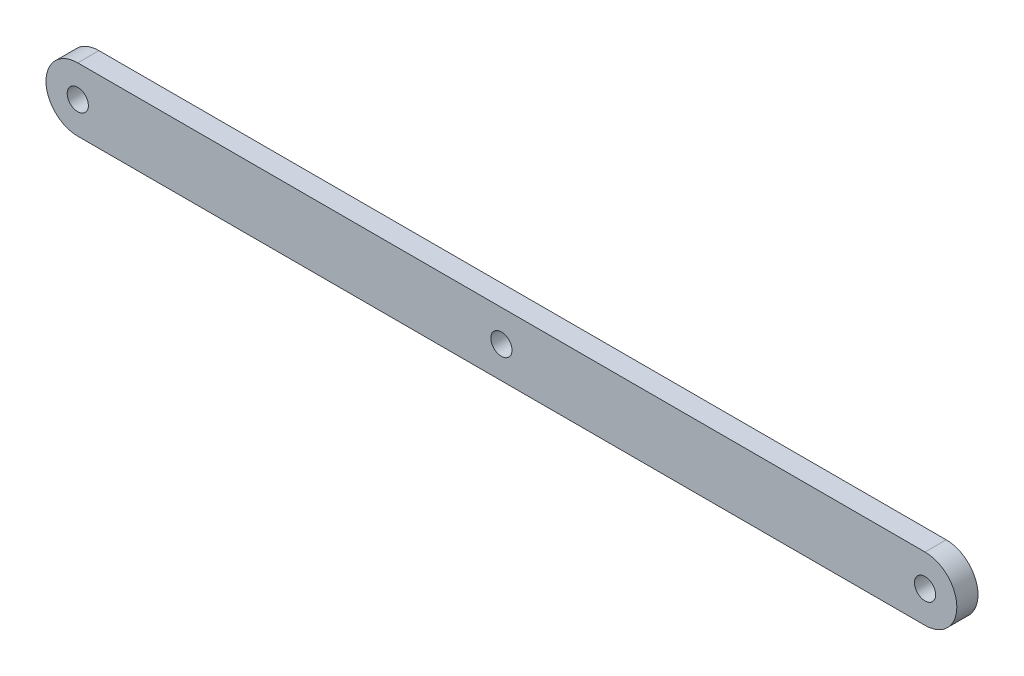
ISO-10303-21;
HEADER;
FILE_DESCRIPTION(('STEP AP214'),'2;1');
FILE_NAME('part.step','',(''),(''),'','','');
FILE_SCHEMA(('AUTOMOTIVE_DESIGN { 1 0 10303 214 1 1 1 1 }'));
ENDSEC;
DATA;
#1=APPLICATION_CONTEXT('core data for automotive mechanical design processes');
#2=APPLICATION_PROTOCOL_DEFINITION('international standard','automotive_design',2000,#1);
#3=PRODUCT_CONTEXT('',#1,'mechanical');
#4=PRODUCT('Part','Part','',(#3));
#5=PRODUCT_RELATED_PRODUCT_CATEGORY('part','',(#4));
#6=PRODUCT_DEFINITION_FORMATION('','',#4);
#7=PRODUCT_DEFINITION_CONTEXT('part definition',#1,'design');
#8=PRODUCT_DEFINITION('design','',#6,#7);
#9=PRODUCT_DEFINITION_SHAPE('','',#8);
#10=(LENGTH_UNIT() NAMED_UNIT(*) SI_UNIT(.MILLI.,.METRE.));
#11=(NAMED_UNIT(*) PLANE_ANGLE_UNIT() SI_UNIT($,.RADIAN.));
#12=(NAMED_UNIT(*) SI_UNIT($,.STERADIAN.) SOLID_ANGLE_UNIT());
#13=UNCERTAINTY_MEASURE_WITH_UNIT(LENGTH_MEASURE(1.E-05),#10,'distance_accuracy_value','');
#14=(GEOMETRIC_REPRESENTATION_CONTEXT(3) GLOBAL_UNCERTAINTY_ASSIGNED_CONTEXT((#13)) GLOBAL_UNIT_ASSIGNED_CONTEXT((#10,
#11,#12)) REPRESENTATION_CONTEXT('',''));
#15=CARTESIAN_POINT('',(0.,0.,0.));
#16=DIRECTION('',(0.,0.,1.));
#17=DIRECTION('',(1.,0.,0.));
#18=AXIS2_PLACEMENT_3D('',#15,#16,#17);
#19=CARTESIAN_POINT('',(0.,19.05,12.7));
#20=DIRECTION('',(0.,0.,1.));
#21=DIRECTION('',(1.,0.,0.));
#22=AXIS2_PLACEMENT_3D('',#19,#20,#21);
#23=PLANE('',#22);
#24=CARTESIAN_POINT('',(254.,19.05,12.7));
#25=DIRECTION('',(0.,0.,1.));
#26=DIRECTION('',(1.,0.,0.));
#27=AXIS2_PLACEMENT_3D('',#24,#25,#26);
#28=CIRCLE('',#27,6.35);
#29=CARTESIAN_POINT('',(260.35,19.05,12.7));
#30=VERTEX_POINT('',#29);
#31=EDGE_CURVE('E127',#30,#30,#28,.T.);
#32=ORIENTED_EDGE('',*,*,#31,.F.);
#33=EDGE_LOOP('',(#32));
#34=FACE_BOUND('',#33,.T.);
#35=CARTESIAN_POINT('',(0.,19.05,12.7));
#36=DIRECTION('',(0.,0.,1.));
#37=DIRECTION('',(1.,0.,0.));
#38=AXIS2_PLACEMENT_3D('',#35,#36,#37);
#39=CIRCLE('',#38,19.05);
#40=CARTESIAN_POINT('',(0.,38.1,12.7));
#41=VERTEX_POINT('',#40);
#42=CARTESIAN_POINT('',(0.,0.,12.7));
#43=VERTEX_POINT('',#42);
#44=EDGE_CURVE('E88',#41,#43,#39,.T.);
#45=ORIENTED_EDGE('',*,*,#44,.T.);
#46=DIRECTION('',(1.,0.,0.));
#47=VECTOR('',#46,1.);
#48=CARTESIAN_POINT('',(0.,0.,12.7));
#49=LINE('',#48,#47);
#50=CARTESIAN_POINT('',(508.,0.,12.7));
#51=VERTEX_POINT('',#50);
#52=EDGE_CURVE('E83',#43,#51,#49,.T.);
#53=ORIENTED_EDGE('',*,*,#52,.T.);
#54=CARTESIAN_POINT('',(508.,19.05,12.7));
#55=DIRECTION('',(0.,0.,1.));
#56=DIRECTION('',(1.,0.,0.));
#57=AXIS2_PLACEMENT_3D('',#54,#55,#56);
#58=CIRCLE('',#57,19.05);
#59=CARTESIAN_POINT('',(508.,38.1,12.7));
#60=VERTEX_POINT('',#59);
#61=EDGE_CURVE('E86',#51,#60,#58,.T.);
#62=ORIENTED_EDGE('',*,*,#61,.T.);
#63=DIRECTION('',(-1.,0.,0.));
#64=VECTOR('',#63,1.);
#65=CARTESIAN_POINT('',(0.,38.1,12.7));
#66=LINE('',#65,#64);
#67=EDGE_CURVE('E53',#60,#41,#66,.T.);
#68=ORIENTED_EDGE('',*,*,#67,.T.);
#69=EDGE_LOOP('',(#45,#53,#62,#68));
#70=FACE_BOUND('',#69,.T.);
#71=CARTESIAN_POINT('',(0.,19.05,12.7));
#72=DIRECTION('',(0.,0.,1.));
#73=DIRECTION('',(1.,0.,0.));
#74=AXIS2_PLACEMENT_3D('',#71,#72,#73);
#75=CIRCLE('',#74,6.35);
#76=CARTESIAN_POINT('',(6.35,19.05,12.7));
#77=VERTEX_POINT('',#76);
#78=EDGE_CURVE('E115',#77,#77,#75,.T.);
#79=ORIENTED_EDGE('',*,*,#78,.F.);
#80=EDGE_LOOP('',(#79));
#81=FACE_BOUND('',#80,.T.);
#82=CARTESIAN_POINT('',(508.,19.05,12.7));
#83=DIRECTION('',(0.,0.,-1.));
#84=DIRECTION('',(-1.,0.,0.));
#85=AXIS2_PLACEMENT_3D('',#82,#83,#84);
#86=CIRCLE('',#85,6.35);
#87=CARTESIAN_POINT('',(501.65,19.05,12.7));
#88=VERTEX_POINT('',#87);
#89=EDGE_CURVE('E121',#88,#88,#86,.T.);
#90=ORIENTED_EDGE('',*,*,#89,.T.);
#91=EDGE_LOOP('',(#90));
#92=FACE_BOUND('',#91,.T.);
#93=ADVANCED_FACE('F36',(#34,#70,#81,#92),#23,.T.);
#94=CARTESIAN_POINT('',(0.,19.05,0.));
#95=DIRECTION('',(0.,0.,1.));
#96=DIRECTION('',(1.,0.,0.));
#97=AXIS2_PLACEMENT_3D('',#94,#95,#96);
#98=PLANE('',#97);
#99=CARTESIAN_POINT('',(254.,19.05,0.));
#100=DIRECTION('',(0.,0.,1.));
#101=DIRECTION('',(1.,0.,0.));
#102=AXIS2_PLACEMENT_3D('',#99,#100,#101);
#103=CIRCLE('',#102,6.35);
#104=CARTESIAN_POINT('',(260.35,19.05,0.));
#105=VERTEX_POINT('',#104);
#106=EDGE_CURVE('E124',#105,#105,#103,.T.);
#107=ORIENTED_EDGE('',*,*,#106,.T.);
#108=EDGE_LOOP('',(#107));
#109=FACE_BOUND('',#108,.T.);
#110=CARTESIAN_POINT('',(0.,19.05,0.));
#111=DIRECTION('',(0.,0.,1.));
#112=DIRECTION('',(1.,0.,0.));
#113=AXIS2_PLACEMENT_3D('',#110,#111,#112);
#114=CIRCLE('',#113,19.05);
#115=CARTESIAN_POINT('',(0.,38.1,0.));
#116=VERTEX_POINT('',#115);
#117=CARTESIAN_POINT('',(0.,0.,0.));
#118=VERTEX_POINT('',#117);
#119=EDGE_CURVE('E100',#116,#118,#114,.T.);
#120=ORIENTED_EDGE('',*,*,#119,.F.);
#121=DIRECTION('',(-1.,0.,0.));
#122=VECTOR('',#121,1.);
#123=CARTESIAN_POINT('',(0.,38.1,0.));
#124=LINE('',#123,#122);
#125=CARTESIAN_POINT('',(508.,38.1,0.));
#126=VERTEX_POINT('',#125);
#127=EDGE_CURVE('E76',#126,#116,#124,.T.);
#128=ORIENTED_EDGE('',*,*,#127,.F.);
#129=CARTESIAN_POINT('',(508.,19.05,0.));
#130=DIRECTION('',(0.,0.,1.));
#131=DIRECTION('',(1.,0.,0.));
#132=AXIS2_PLACEMENT_3D('',#129,#130,#131);
#133=CIRCLE('',#132,19.05);
#134=CARTESIAN_POINT('',(508.,0.,0.));
#135=VERTEX_POINT('',#134);
#136=EDGE_CURVE('E70',#135,#126,#133,.T.);
#137=ORIENTED_EDGE('',*,*,#136,.F.);
#138=DIRECTION('',(1.,0.,0.));
#139=VECTOR('',#138,1.);
#140=CARTESIAN_POINT('',(0.,0.,0.));
#141=LINE('',#140,#139);
#142=EDGE_CURVE('E92',#118,#135,#141,.T.);
#143=ORIENTED_EDGE('',*,*,#142,.F.);
#144=EDGE_LOOP('',(#120,#128,#137,#143));
#145=FACE_BOUND('',#144,.T.);
#146=CARTESIAN_POINT('',(0.,19.05,0.));
#147=DIRECTION('',(0.,0.,1.));
#148=DIRECTION('',(1.,0.,0.));
#149=AXIS2_PLACEMENT_3D('',#146,#147,#148);
#150=CIRCLE('',#149,6.35);
#151=CARTESIAN_POINT('',(6.35,19.05,0.));
#152=VERTEX_POINT('',#151);
#153=EDGE_CURVE('E103',#152,#152,#150,.T.);
#154=ORIENTED_EDGE('',*,*,#153,.T.);
#155=EDGE_LOOP('',(#154));
#156=FACE_BOUND('',#155,.T.);
#157=CARTESIAN_POINT('',(508.,19.05,0.));
#158=DIRECTION('',(0.,0.,-1.));
#159=DIRECTION('',(-1.,0.,0.));
#160=AXIS2_PLACEMENT_3D('',#157,#158,#159);
#161=CIRCLE('',#160,6.35);
#162=CARTESIAN_POINT('',(501.65,19.05,0.));
#163=VERTEX_POINT('',#162);
#164=EDGE_CURVE('E118',#163,#163,#161,.T.);
#165=ORIENTED_EDGE('',*,*,#164,.F.);
#166=EDGE_LOOP('',(#165));
#167=FACE_BOUND('',#166,.T.);
#168=ADVANCED_FACE('F111',(#109,#145,#156,#167),#98,.F.);
#169=CARTESIAN_POINT('',(0.,19.05,12.7));
#170=DIRECTION('',(0.,0.,-1.));
#171=DIRECTION('',(-1.,0.,0.));
#172=AXIS2_PLACEMENT_3D('',#169,#170,#171);
#173=CYLINDRICAL_SURFACE('',#172,19.05);
#174=ORIENTED_EDGE('',*,*,#119,.T.);
#175=DIRECTION('',(0.,0.,-1.));
#176=VECTOR('',#175,1.);
#177=CARTESIAN_POINT('',(0.,0.,12.7));
#178=LINE('',#177,#176);
#179=EDGE_CURVE('E11',#43,#118,#178,.T.);
#180=ORIENTED_EDGE('',*,*,#179,.F.);
#181=ORIENTED_EDGE('',*,*,#44,.F.);
#182=DIRECTION('',(0.,0.,-1.));
#183=VECTOR('',#182,1.);
#184=CARTESIAN_POINT('',(0.,38.1,12.7));
#185=LINE('',#184,#183);
#186=EDGE_CURVE('E96',#41,#116,#185,.T.);
#187=ORIENTED_EDGE('',*,*,#186,.T.);
#188=EDGE_LOOP('',(#174,#180,#181,#187));
#189=FACE_BOUND('',#188,.T.);
#190=ADVANCED_FACE('F38',(#189),#173,.T.);
#191=CARTESIAN_POINT('',(0.,0.,12.7));
#192=DIRECTION('',(0.,1.,0.));
#193=DIRECTION('',(0.,0.,1.));
#194=AXIS2_PLACEMENT_3D('',#191,#192,#193);
#195=PLANE('',#194);
#196=ORIENTED_EDGE('',*,*,#142,.T.);
#197=DIRECTION('',(0.,0.,-1.));
#198=VECTOR('',#197,1.);
#199=CARTESIAN_POINT('',(508.,0.,12.7));
#200=LINE('',#199,#198);
#201=EDGE_CURVE('E45',#51,#135,#200,.T.);
#202=ORIENTED_EDGE('',*,*,#201,.F.);
#203=ORIENTED_EDGE('',*,*,#52,.F.);
#204=ORIENTED_EDGE('',*,*,#179,.T.);
#205=EDGE_LOOP('',(#196,#202,#203,#204));
#206=FACE_BOUND('',#205,.T.);
#207=ADVANCED_FACE('F91',(#206),#195,.F.);
#208=CARTESIAN_POINT('',(508.,19.05,12.7));
#209=DIRECTION('',(0.,0.,-1.));
#210=DIRECTION('',(-1.,0.,0.));
#211=AXIS2_PLACEMENT_3D('',#208,#209,#210);
#212=CYLINDRICAL_SURFACE('',#211,19.05);
#213=ORIENTED_EDGE('',*,*,#136,.T.);
#214=DIRECTION('',(0.,0.,-1.));
#215=VECTOR('',#214,1.);
#216=CARTESIAN_POINT('',(508.,38.1,12.7));
#217=LINE('',#216,#215);
#218=EDGE_CURVE('E93',#60,#126,#217,.T.);
#219=ORIENTED_EDGE('',*,*,#218,.F.);
#220=ORIENTED_EDGE('',*,*,#61,.F.);
#221=ORIENTED_EDGE('',*,*,#201,.T.);
#222=EDGE_LOOP('',(#213,#219,#220,#221));
#223=FACE_BOUND('',#222,.T.);
#224=ADVANCED_FACE('F94',(#223),#212,.T.);
#225=CARTESIAN_POINT('',(0.,38.1,12.7));
#226=DIRECTION('',(0.,-1.,0.));
#227=DIRECTION('',(0.,0.,-1.));
#228=AXIS2_PLACEMENT_3D('',#225,#226,#227);
#229=PLANE('',#228);
#230=ORIENTED_EDGE('',*,*,#127,.T.);
#231=ORIENTED_EDGE('',*,*,#186,.F.);
#232=ORIENTED_EDGE('',*,*,#67,.F.);
#233=ORIENTED_EDGE('',*,*,#218,.T.);
#234=EDGE_LOOP('',(#230,#231,#232,#233));
#235=FACE_BOUND('',#234,.T.);
#236=ADVANCED_FACE('F108',(#235),#229,.F.);
#237=CARTESIAN_POINT('',(0.,19.05,0.));
#238=DIRECTION('',(0.,0.,1.));
#239=DIRECTION('',(1.,0.,0.));
#240=AXIS2_PLACEMENT_3D('',#237,#238,#239);
#241=CYLINDRICAL_SURFACE('',#240,6.35);
#242=ORIENTED_EDGE('',*,*,#153,.F.);
#243=EDGE_LOOP('',(#242));
#244=FACE_BOUND('',#243,.T.);
#245=ORIENTED_EDGE('',*,*,#78,.T.);
#246=EDGE_LOOP('',(#245));
#247=FACE_BOUND('',#246,.T.);
#248=ADVANCED_FACE('F148',(#244,#247),#241,.F.);
#249=CARTESIAN_POINT('',(508.,19.05,0.));
#250=DIRECTION('',(0.,0.,1.));
#251=DIRECTION('',(1.,0.,0.));
#252=AXIS2_PLACEMENT_3D('',#249,#250,#251);
#253=CYLINDRICAL_SURFACE('',#252,6.35);
#254=ORIENTED_EDGE('',*,*,#164,.T.);
#255=EDGE_LOOP('',(#254));
#256=FACE_BOUND('',#255,.T.);
#257=ORIENTED_EDGE('',*,*,#89,.F.);
#258=EDGE_LOOP('',(#257));
#259=FACE_BOUND('',#258,.T.);
#260=ADVANCED_FACE('F137',(#256,#259),#253,.F.);
#261=CARTESIAN_POINT('',(254.,19.05,0.));
#262=DIRECTION('',(0.,0.,1.));
#263=DIRECTION('',(1.,0.,0.));
#264=AXIS2_PLACEMENT_3D('',#261,#262,#263);
#265=CYLINDRICAL_SURFACE('',#264,6.35);
#266=ORIENTED_EDGE('',*,*,#106,.F.);
#267=EDGE_LOOP('',(#266));
#268=FACE_BOUND('',#267,.T.);
#269=ORIENTED_EDGE('',*,*,#31,.T.);
#270=EDGE_LOOP('',(#269));
#271=FACE_BOUND('',#270,.T.);
#272=ADVANCED_FACE('F134',(#268,#271),#265,.F.);
#273=CLOSED_SHELL('',(#93,#168,#190,#207,#224,#236,#248,#260,#272));
#274=MANIFOLD_SOLID_BREP('B2',#273);
#275=ADVANCED_BREP_SHAPE_REPRESENTATION('',(#18,#274),#14);
#276=SHAPE_DEFINITION_REPRESENTATION(#9,#275);
ENDSEC;
END-ISO-10303-21;
